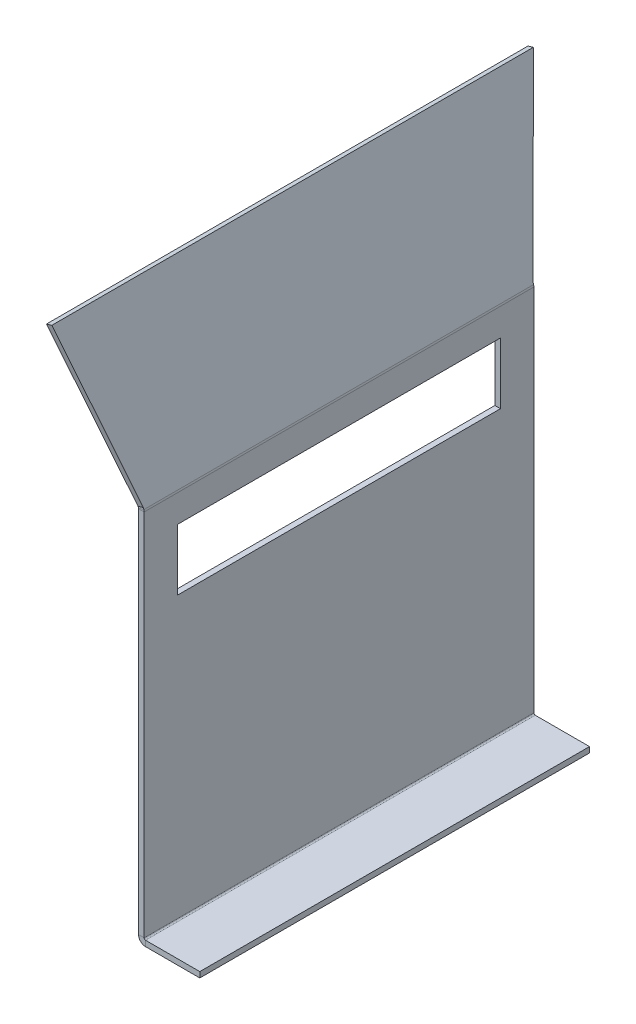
ISO-10303-21;
HEADER;
FILE_DESCRIPTION(('STEP AP214'),'2;1');
FILE_NAME('part.step','',(''),(''),'','','');
FILE_SCHEMA(('AUTOMOTIVE_DESIGN { 1 0 10303 214 1 1 1 1 }'));
ENDSEC;
DATA;
#1=APPLICATION_CONTEXT('core data for automotive mechanical design processes');
#2=APPLICATION_PROTOCOL_DEFINITION('international standard','automotive_design',2000,#1);
#3=PRODUCT_CONTEXT('',#1,'mechanical');
#4=PRODUCT('Part','Part','',(#3));
#5=PRODUCT_RELATED_PRODUCT_CATEGORY('part','',(#4));
#6=PRODUCT_DEFINITION_FORMATION('','',#4);
#7=PRODUCT_DEFINITION_CONTEXT('part definition',#1,'design');
#8=PRODUCT_DEFINITION('design','',#6,#7);
#9=PRODUCT_DEFINITION_SHAPE('','',#8);
#10=(LENGTH_UNIT() NAMED_UNIT(*) SI_UNIT(.MILLI.,.METRE.));
#11=(NAMED_UNIT(*) PLANE_ANGLE_UNIT() SI_UNIT($,.RADIAN.));
#12=(NAMED_UNIT(*) SI_UNIT($,.STERADIAN.) SOLID_ANGLE_UNIT());
#13=UNCERTAINTY_MEASURE_WITH_UNIT(LENGTH_MEASURE(1.E-05),#10,'distance_accuracy_value','');
#14=(GEOMETRIC_REPRESENTATION_CONTEXT(3) GLOBAL_UNCERTAINTY_ASSIGNED_CONTEXT((#13)) GLOBAL_UNIT_ASSIGNED_CONTEXT((#10,
#11,#12)) REPRESENTATION_CONTEXT('',''));
#15=CARTESIAN_POINT('',(0.,0.,0.));
#16=DIRECTION('',(0.,0.,1.));
#17=DIRECTION('',(1.,0.,0.));
#18=AXIS2_PLACEMENT_3D('',#15,#16,#17);
#19=CARTESIAN_POINT('',(0.,200.,130.));
#20=DIRECTION('',(-0.960645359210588,-0.277777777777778,0.));
#21=DIRECTION('',(0.277777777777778,-0.960645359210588,0.));
#22=AXIS2_PLACEMENT_3D('',#19,#20,#21);
#23=PLANE('',#22);
#24=DIRECTION('',(0.277777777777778,-0.960645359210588,0.));
#25=VECTOR('',#24,1.);
#26=CARTESIAN_POINT('',(0.,200.,105.));
#27=LINE('',#26,#25);
#28=CARTESIAN_POINT('',(-0.388544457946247,201.343712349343,105.));
#29=VERTEX_POINT('',#28);
#30=CARTESIAN_POINT('',(-0.147579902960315,200.51037901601,105.));
#31=VERTEX_POINT('',#30);
#32=EDGE_CURVE('E618',#29,#31,#27,.T.);
#33=ORIENTED_EDGE('',*,*,#32,.T.);
#34=DIRECTION('',(0.,0.,-1.));
#35=VECTOR('',#34,1.);
#36=CARTESIAN_POINT('',(-0.147579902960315,200.51037901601,130.));
#37=LINE('',#36,#35);
#38=CARTESIAN_POINT('',(-0.147579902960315,200.51037901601,-105.));
#39=VERTEX_POINT('',#38);
#40=EDGE_CURVE('E626',#31,#39,#37,.T.);
#41=ORIENTED_EDGE('',*,*,#40,.T.);
#42=DIRECTION('',(0.277777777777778,-0.960645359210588,0.));
#43=VECTOR('',#42,1.);
#44=CARTESIAN_POINT('',(0.,200.,-105.));
#45=LINE('',#44,#43);
#46=CARTESIAN_POINT('',(-0.388544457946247,201.343712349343,-105.));
#47=VERTEX_POINT('',#46);
#48=EDGE_CURVE('E561',#47,#39,#45,.T.);
#49=ORIENTED_EDGE('',*,*,#48,.F.);
#50=DIRECTION('',(0.267552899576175,-0.925284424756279,0.268819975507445));
#51=VECTOR('',#50,1.);
#52=CARTESIAN_POINT('',(-1.82616694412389,206.315475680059,-106.444430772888));
#53=LINE('',#52,#51);
#54=CARTESIAN_POINT('',(-25.,286.458082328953,-129.728010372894));
#55=VERTEX_POINT('',#54);
#56=EDGE_CURVE('E560',#55,#47,#53,.T.);
#57=ORIENTED_EDGE('',*,*,#56,.F.);
#58=DIRECTION('',(0.,0.,-1.));
#59=VECTOR('',#58,1.);
#60=CARTESIAN_POINT('',(-25.,286.458082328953,130.));
#61=LINE('',#60,#59);
#62=CARTESIAN_POINT('',(-25.,286.458082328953,129.728010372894));
#63=VERTEX_POINT('',#62);
#64=EDGE_CURVE('E363',#63,#55,#61,.T.);
#65=ORIENTED_EDGE('',*,*,#64,.F.);
#66=DIRECTION('',(0.267552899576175,-0.925284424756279,-0.268819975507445));
#67=VECTOR('',#66,1.);
#68=CARTESIAN_POINT('',(-1.82616694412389,206.315475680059,106.444430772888));
#69=LINE('',#68,#67);
#70=EDGE_CURVE('E390',#63,#29,#69,.T.);
#71=ORIENTED_EDGE('',*,*,#70,.T.);
#72=EDGE_LOOP('',(#33,#41,#49,#57,#65,#71));
#73=FACE_BOUND('',#72,.T.);
#74=ADVANCED_FACE('F356',(#73),#23,.F.);
#75=CARTESIAN_POINT('',(-27.8819360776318,285.62474899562,130.));
#76=DIRECTION('',(-0.277777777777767,0.960645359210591,0.));
#77=DIRECTION('',(-0.960645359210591,-0.277777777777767,0.));
#78=AXIS2_PLACEMENT_3D('',#75,#76,#77);
#79=PLANE('',#78);
#80=DIRECTION('',(0.,0.,-1.));
#81=VECTOR('',#80,1.);
#82=CARTESIAN_POINT('',(-27.8819360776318,285.62474899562,130.));
#83=LINE('',#82,#81);
#84=CARTESIAN_POINT('',(-27.8819360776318,285.62474899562,129.728010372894));
#85=VERTEX_POINT('',#84);
#86=CARTESIAN_POINT('',(-27.8819360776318,285.62474899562,-129.728010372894));
#87=VERTEX_POINT('',#86);
#88=EDGE_CURVE('E646',#85,#87,#83,.T.);
#89=ORIENTED_EDGE('',*,*,#88,.F.);
#90=DIRECTION('',(-0.960645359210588,-0.277777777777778,0.));
#91=VECTOR('',#90,1.);
#92=CARTESIAN_POINT('',(-27.8819360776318,285.62474899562,129.728010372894));
#93=LINE('',#92,#91);
#94=EDGE_CURVE('E398',#85,#63,#93,.F.);
#95=ORIENTED_EDGE('',*,*,#94,.T.);
#96=ORIENTED_EDGE('',*,*,#64,.T.);
#97=DIRECTION('',(-0.960645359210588,-0.277777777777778,0.));
#98=VECTOR('',#97,1.);
#99=CARTESIAN_POINT('',(-27.8819360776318,285.62474899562,-129.728010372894));
#100=LINE('',#99,#98);
#101=EDGE_CURVE('E564',#87,#55,#100,.F.);
#102=ORIENTED_EDGE('',*,*,#101,.F.);
#103=EDGE_LOOP('',(#89,#95,#96,#102));
#104=FACE_BOUND('',#103,.T.);
#105=ADVANCED_FACE('F651',(#104),#79,.T.);
#106=CARTESIAN_POINT('',(-2.88193607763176,199.166666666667,130.));
#107=DIRECTION('',(-0.960645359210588,-0.277777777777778,0.));
#108=DIRECTION('',(0.277777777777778,-0.960645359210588,0.));
#109=AXIS2_PLACEMENT_3D('',#106,#107,#108);
#110=PLANE('',#109);
#111=DIRECTION('',(0.,0.,-1.));
#112=VECTOR('',#111,1.);
#113=CARTESIAN_POINT('',(-3.02951598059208,199.677045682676,130.));
#114=LINE('',#113,#112);
#115=CARTESIAN_POINT('',(-3.02951598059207,199.677045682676,105.));
#116=VERTEX_POINT('',#115);
#117=CARTESIAN_POINT('',(-3.02951598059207,199.677045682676,-105.));
#118=VERTEX_POINT('',#117);
#119=EDGE_CURVE('E644',#116,#118,#114,.T.);
#120=ORIENTED_EDGE('',*,*,#119,.F.);
#121=DIRECTION('',(0.277777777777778,-0.960645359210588,0.));
#122=VECTOR('',#121,1.);
#123=CARTESIAN_POINT('',(-2.88193607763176,199.166666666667,105.));
#124=LINE('',#123,#122);
#125=CARTESIAN_POINT('',(-3.27048053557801,200.51037901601,105.));
#126=VERTEX_POINT('',#125);
#127=EDGE_CURVE('E616',#126,#116,#124,.T.);
#128=ORIENTED_EDGE('',*,*,#127,.F.);
#129=DIRECTION('',(0.267552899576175,-0.925284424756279,-0.268819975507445));
#130=VECTOR('',#129,1.);
#131=CARTESIAN_POINT('',(-4.70810302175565,205.482142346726,106.444430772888));
#132=LINE('',#131,#130);
#133=EDGE_CURVE('E395',#85,#126,#132,.T.);
#134=ORIENTED_EDGE('',*,*,#133,.F.);
#135=ORIENTED_EDGE('',*,*,#88,.T.);
#136=DIRECTION('',(0.267552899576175,-0.925284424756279,0.268819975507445));
#137=VECTOR('',#136,1.);
#138=CARTESIAN_POINT('',(-4.70810302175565,205.482142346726,-106.444430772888));
#139=LINE('',#138,#137);
#140=CARTESIAN_POINT('',(-3.27048053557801,200.51037901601,-105.));
#141=VERTEX_POINT('',#140);
#142=EDGE_CURVE('E552',#87,#141,#139,.T.);
#143=ORIENTED_EDGE('',*,*,#142,.T.);
#144=DIRECTION('',(0.277777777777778,-0.960645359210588,0.));
#145=VECTOR('',#144,1.);
#146=CARTESIAN_POINT('',(-2.88193607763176,199.166666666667,-105.));
#147=LINE('',#146,#145);
#148=EDGE_CURVE('E557',#141,#118,#147,.T.);
#149=ORIENTED_EDGE('',*,*,#148,.T.);
#150=EDGE_LOOP('',(#120,#128,#134,#135,#143,#149));
#151=FACE_BOUND('',#150,.T.);
#152=ADVANCED_FACE('F666',(#151),#110,.T.);
#153=CARTESIAN_POINT('',(-3.75000000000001,199.468712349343,130.));
#154=DIRECTION('',(0.,0.,-1.));
#155=DIRECTION('',(-1.,0.,0.));
#156=AXIS2_PLACEMENT_3D('',#153,#154,#155);
#157=CYLINDRICAL_SURFACE('',#156,0.75);
#158=DIRECTION('',(0.,0.,-1.));
#159=VECTOR('',#158,1.);
#160=CARTESIAN_POINT('',(-3.00000000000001,199.468712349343,130.));
#161=LINE('',#160,#159);
#162=CARTESIAN_POINT('',(-3.00000000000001,199.468712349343,105.));
#163=VERTEX_POINT('',#162);
#164=CARTESIAN_POINT('',(-3.00000000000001,199.468712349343,-105.));
#165=VERTEX_POINT('',#164);
#166=EDGE_CURVE('E642',#163,#165,#161,.T.);
#167=ORIENTED_EDGE('',*,*,#166,.F.);
#168=CARTESIAN_POINT('',(-3.75000000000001,199.468712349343,105.));
#169=DIRECTION('',(0.,0.,-1.));
#170=DIRECTION('',(-1.,0.,0.));
#171=AXIS2_PLACEMENT_3D('',#168,#169,#170);
#172=CIRCLE('',#171,0.75);
#173=EDGE_CURVE('E588',#116,#163,#172,.T.);
#174=ORIENTED_EDGE('',*,*,#173,.F.);
#175=ORIENTED_EDGE('',*,*,#119,.T.);
#176=CARTESIAN_POINT('',(-3.75000000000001,199.468712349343,-105.));
#177=DIRECTION('',(0.,0.,-1.));
#178=DIRECTION('',(-1.,0.,0.));
#179=AXIS2_PLACEMENT_3D('',#176,#177,#178);
#180=CIRCLE('',#179,0.75);
#181=EDGE_CURVE('E521',#118,#165,#180,.T.);
#182=ORIENTED_EDGE('',*,*,#181,.T.);
#183=EDGE_LOOP('',(#167,#174,#175,#182));
#184=FACE_BOUND('',#183,.T.);
#185=ADVANCED_FACE('F672',(#184),#157,.F.);
#186=CARTESIAN_POINT('',(-3.,0.,130.));
#187=DIRECTION('',(-1.,0.,0.));
#188=DIRECTION('',(0.,0.,1.));
#189=AXIS2_PLACEMENT_3D('',#186,#187,#188);
#190=PLANE('',#189);
#191=ORIENTED_EDGE('',*,*,#166,.T.);
#192=DIRECTION('',(0.,1.,0.));
#193=VECTOR('',#192,1.);
#194=CARTESIAN_POINT('',(-3.,0.,-105.));
#195=LINE('',#194,#193);
#196=CARTESIAN_POINT('',(-3.,0.75,-105.));
#197=VERTEX_POINT('',#196);
#198=EDGE_CURVE('E545',#165,#197,#195,.F.);
#199=ORIENTED_EDGE('',*,*,#198,.T.);
#200=DIRECTION('',(0.,0.,-1.));
#201=VECTOR('',#200,1.);
#202=CARTESIAN_POINT('',(-3.,0.75,130.));
#203=LINE('',#202,#201);
#204=CARTESIAN_POINT('',(-3.,0.75,105.));
#205=VERTEX_POINT('',#204);
#206=EDGE_CURVE('E640',#205,#197,#203,.T.);
#207=ORIENTED_EDGE('',*,*,#206,.F.);
#208=DIRECTION('',(0.,1.,0.));
#209=VECTOR('',#208,1.);
#210=CARTESIAN_POINT('',(-3.,0.,105.));
#211=LINE('',#210,#209);
#212=EDGE_CURVE('E609',#163,#205,#211,.F.);
#213=ORIENTED_EDGE('',*,*,#212,.F.);
#214=EDGE_LOOP('',(#191,#199,#207,#213));
#215=FACE_BOUND('',#214,.T.);
#216=DIRECTION('',(0.,0.,-1.));
#217=VECTOR('',#216,1.);
#218=CARTESIAN_POINT('',(-3.,184.677045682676,-26.6001579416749));
#219=LINE('',#218,#217);
#220=CARTESIAN_POINT('',(-3.,184.677045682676,87.));
#221=VERTEX_POINT('',#220);
#222=CARTESIAN_POINT('',(-3.,184.677045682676,-87.));
#223=VERTEX_POINT('',#222);
#224=EDGE_CURVE('E576',#221,#223,#219,.T.);
#225=ORIENTED_EDGE('',*,*,#224,.F.);
#226=DIRECTION('',(0.,1.,0.));
#227=VECTOR('',#226,1.);
#228=CARTESIAN_POINT('',(-3.,184.677045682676,87.));
#229=LINE('',#228,#227);
#230=CARTESIAN_POINT('',(-3.,151.677045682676,87.));
#231=VERTEX_POINT('',#230);
#232=EDGE_CURVE('E497',#231,#221,#229,.T.);
#233=ORIENTED_EDGE('',*,*,#232,.F.);
#234=DIRECTION('',(0.,0.,1.));
#235=VECTOR('',#234,1.);
#236=CARTESIAN_POINT('',(-3.,151.677045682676,-26.6001579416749));
#237=LINE('',#236,#235);
#238=CARTESIAN_POINT('',(-3.,151.677045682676,-87.));
#239=VERTEX_POINT('',#238);
#240=EDGE_CURVE('E490',#239,#231,#237,.T.);
#241=ORIENTED_EDGE('',*,*,#240,.F.);
#242=DIRECTION('',(0.,1.,0.));
#243=VECTOR('',#242,1.);
#244=CARTESIAN_POINT('',(-3.,184.677045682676,-87.));
#245=LINE('',#244,#243);
#246=EDGE_CURVE('E495',#239,#223,#245,.T.);
#247=ORIENTED_EDGE('',*,*,#246,.T.);
#248=EDGE_LOOP('',(#225,#233,#241,#247));
#249=FACE_BOUND('',#248,.T.);
#250=ADVANCED_FACE('F493',(#215,#249),#190,.T.);
#251=CARTESIAN_POINT('',(0.75,0.75,130.));
#252=DIRECTION('',(0.,0.,-1.));
#253=DIRECTION('',(-1.,0.,0.));
#254=AXIS2_PLACEMENT_3D('',#251,#252,#253);
#255=CYLINDRICAL_SURFACE('',#254,3.75);
#256=DIRECTION('',(0.,0.,-1.));
#257=VECTOR('',#256,1.);
#258=CARTESIAN_POINT('',(0.75,-3.,130.));
#259=LINE('',#258,#257);
#260=CARTESIAN_POINT('',(0.750000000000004,-3.,105.));
#261=VERTEX_POINT('',#260);
#262=CARTESIAN_POINT('',(0.750000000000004,-3.,-105.));
#263=VERTEX_POINT('',#262);
#264=EDGE_CURVE('E638',#261,#263,#259,.T.);
#265=ORIENTED_EDGE('',*,*,#264,.F.);
#266=CARTESIAN_POINT('',(0.75,0.75,105.));
#267=DIRECTION('',(0.,0.,-1.));
#268=DIRECTION('',(-1.,0.,0.));
#269=AXIS2_PLACEMENT_3D('',#266,#267,#268);
#270=CIRCLE('',#269,3.75);
#271=EDGE_CURVE('E593',#205,#261,#270,.F.);
#272=ORIENTED_EDGE('',*,*,#271,.F.);
#273=ORIENTED_EDGE('',*,*,#206,.T.);
#274=CARTESIAN_POINT('',(0.75,0.75,-105.));
#275=DIRECTION('',(0.,0.,-1.));
#276=DIRECTION('',(-1.,0.,0.));
#277=AXIS2_PLACEMENT_3D('',#274,#275,#276);
#278=CIRCLE('',#277,3.75);
#279=EDGE_CURVE('E527',#197,#263,#278,.F.);
#280=ORIENTED_EDGE('',*,*,#279,.T.);
#281=EDGE_LOOP('',(#265,#272,#273,#280));
#282=FACE_BOUND('',#281,.T.);
#283=ADVANCED_FACE('F683',(#282),#255,.T.);
#284=CARTESIAN_POINT('',(30.,-3.,130.));
#285=DIRECTION('',(0.,-1.,0.));
#286=DIRECTION('',(1.,0.,0.));
#287=AXIS2_PLACEMENT_3D('',#284,#285,#286);
#288=PLANE('',#287);
#289=DIRECTION('',(0.,0.,-1.));
#290=VECTOR('',#289,1.);
#291=CARTESIAN_POINT('',(30.,-3.,130.));
#292=LINE('',#291,#290);
#293=CARTESIAN_POINT('',(30.,-3.,105.));
#294=VERTEX_POINT('',#293);
#295=CARTESIAN_POINT('',(30.,-3.,-105.));
#296=VERTEX_POINT('',#295);
#297=EDGE_CURVE('E636',#294,#296,#292,.T.);
#298=ORIENTED_EDGE('',*,*,#297,.F.);
#299=DIRECTION('',(1.,0.,0.));
#300=VECTOR('',#299,1.);
#301=CARTESIAN_POINT('',(30.,-3.,105.));
#302=LINE('',#301,#300);
#303=EDGE_CURVE('E598',#261,#294,#302,.T.);
#304=ORIENTED_EDGE('',*,*,#303,.F.);
#305=ORIENTED_EDGE('',*,*,#264,.T.);
#306=DIRECTION('',(1.,0.,0.));
#307=VECTOR('',#306,1.);
#308=CARTESIAN_POINT('',(30.,-3.,-105.));
#309=LINE('',#308,#307);
#310=EDGE_CURVE('E533',#263,#296,#309,.T.);
#311=ORIENTED_EDGE('',*,*,#310,.T.);
#312=EDGE_LOOP('',(#298,#304,#305,#311));
#313=FACE_BOUND('',#312,.T.);
#314=ADVANCED_FACE('F701',(#313),#288,.T.);
#315=CARTESIAN_POINT('',(30.,0.,130.));
#316=DIRECTION('',(1.,0.,0.));
#317=DIRECTION('',(0.,0.,-1.));
#318=AXIS2_PLACEMENT_3D('',#315,#316,#317);
#319=PLANE('',#318);
#320=DIRECTION('',(0.,0.,-1.));
#321=VECTOR('',#320,1.);
#322=CARTESIAN_POINT('',(30.,0.,130.));
#323=LINE('',#322,#321);
#324=CARTESIAN_POINT('',(30.,0.,105.));
#325=VERTEX_POINT('',#324);
#326=CARTESIAN_POINT('',(30.,0.,-105.));
#327=VERTEX_POINT('',#326);
#328=EDGE_CURVE('E634',#325,#327,#323,.T.);
#329=ORIENTED_EDGE('',*,*,#328,.F.);
#330=DIRECTION('',(0.,1.,0.));
#331=VECTOR('',#330,1.);
#332=CARTESIAN_POINT('',(30.,0.,105.));
#333=LINE('',#332,#331);
#334=EDGE_CURVE('E601',#325,#294,#333,.F.);
#335=ORIENTED_EDGE('',*,*,#334,.T.);
#336=ORIENTED_EDGE('',*,*,#297,.T.);
#337=DIRECTION('',(0.,1.,0.));
#338=VECTOR('',#337,1.);
#339=CARTESIAN_POINT('',(30.,0.,-105.));
#340=LINE('',#339,#338);
#341=EDGE_CURVE('E537',#327,#296,#340,.F.);
#342=ORIENTED_EDGE('',*,*,#341,.F.);
#343=EDGE_LOOP('',(#329,#335,#336,#342));
#344=FACE_BOUND('',#343,.T.);
#345=ADVANCED_FACE('F708',(#344),#319,.T.);
#346=CARTESIAN_POINT('',(30.,0.,130.));
#347=DIRECTION('',(0.,-1.,0.));
#348=DIRECTION('',(1.,0.,0.));
#349=AXIS2_PLACEMENT_3D('',#346,#347,#348);
#350=PLANE('',#349);
#351=DIRECTION('',(1.,0.,0.));
#352=VECTOR('',#351,1.);
#353=CARTESIAN_POINT('',(30.,0.,105.));
#354=LINE('',#353,#352);
#355=CARTESIAN_POINT('',(0.750000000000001,0.,105.));
#356=VERTEX_POINT('',#355);
#357=EDGE_CURVE('E595',#356,#325,#354,.T.);
#358=ORIENTED_EDGE('',*,*,#357,.T.);
#359=ORIENTED_EDGE('',*,*,#328,.T.);
#360=DIRECTION('',(1.,0.,0.));
#361=VECTOR('',#360,1.);
#362=CARTESIAN_POINT('',(30.,0.,-105.));
#363=LINE('',#362,#361);
#364=CARTESIAN_POINT('',(0.750000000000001,0.,-105.));
#365=VERTEX_POINT('',#364);
#366=EDGE_CURVE('E530',#365,#327,#363,.T.);
#367=ORIENTED_EDGE('',*,*,#366,.F.);
#368=DIRECTION('',(0.,0.,-1.));
#369=VECTOR('',#368,1.);
#370=CARTESIAN_POINT('',(0.750000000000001,0.,130.));
#371=LINE('',#370,#369);
#372=EDGE_CURVE('E632',#356,#365,#371,.T.);
#373=ORIENTED_EDGE('',*,*,#372,.F.);
#374=EDGE_LOOP('',(#358,#359,#367,#373));
#375=FACE_BOUND('',#374,.T.);
#376=ADVANCED_FACE('F710',(#375),#350,.F.);
#377=CARTESIAN_POINT('',(0.75,0.75,130.));
#378=DIRECTION('',(0.,0.,-1.));
#379=DIRECTION('',(-1.,0.,0.));
#380=AXIS2_PLACEMENT_3D('',#377,#378,#379);
#381=CYLINDRICAL_SURFACE('',#380,0.75);
#382=CARTESIAN_POINT('',(0.75,0.75,105.));
#383=DIRECTION('',(0.,0.,-1.));
#384=DIRECTION('',(0.,1.,0.));
#385=AXIS2_PLACEMENT_3D('',#382,#383,#384);
#386=CIRCLE('',#385,0.75);
#387=CARTESIAN_POINT('',(0.,0.75,105.));
#388=VERTEX_POINT('',#387);
#389=EDGE_CURVE('E590',#388,#356,#386,.F.);
#390=ORIENTED_EDGE('',*,*,#389,.T.);
#391=ORIENTED_EDGE('',*,*,#372,.T.);
#392=CARTESIAN_POINT('',(0.75,0.75,-105.));
#393=DIRECTION('',(0.,0.,-1.));
#394=DIRECTION('',(0.,1.,0.));
#395=AXIS2_PLACEMENT_3D('',#392,#393,#394);
#396=CIRCLE('',#395,0.75);
#397=CARTESIAN_POINT('',(0.,0.75,-105.));
#398=VERTEX_POINT('',#397);
#399=EDGE_CURVE('E524',#398,#365,#396,.F.);
#400=ORIENTED_EDGE('',*,*,#399,.F.);
#401=DIRECTION('',(0.,0.,-1.));
#402=VECTOR('',#401,1.);
#403=CARTESIAN_POINT('',(0.,0.75,130.));
#404=LINE('',#403,#402);
#405=EDGE_CURVE('E630',#388,#398,#404,.T.);
#406=ORIENTED_EDGE('',*,*,#405,.F.);
#407=EDGE_LOOP('',(#390,#391,#400,#406));
#408=FACE_BOUND('',#407,.T.);
#409=ADVANCED_FACE('F717',(#408),#381,.F.);
#410=CARTESIAN_POINT('',(0.,0.,130.));
#411=DIRECTION('',(-1.,0.,0.));
#412=DIRECTION('',(0.,0.,1.));
#413=AXIS2_PLACEMENT_3D('',#410,#411,#412);
#414=PLANE('',#413);
#415=DIRECTION('',(0.,-1.,0.));
#416=VECTOR('',#415,1.);
#417=CARTESIAN_POINT('',(0.,0.,-105.));
#418=LINE('',#417,#416);
#419=CARTESIAN_POINT('',(0.,199.468712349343,-105.));
#420=VERTEX_POINT('',#419);
#421=EDGE_CURVE('E540',#420,#398,#418,.T.);
#422=ORIENTED_EDGE('',*,*,#421,.F.);
#423=DIRECTION('',(0.,0.,-1.));
#424=VECTOR('',#423,1.);
#425=CARTESIAN_POINT('',(0.,199.468712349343,130.));
#426=LINE('',#425,#424);
#427=CARTESIAN_POINT('',(0.,199.468712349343,105.));
#428=VERTEX_POINT('',#427);
#429=EDGE_CURVE('E628',#428,#420,#426,.T.);
#430=ORIENTED_EDGE('',*,*,#429,.F.);
#431=DIRECTION('',(0.,-1.,0.));
#432=VECTOR('',#431,1.);
#433=CARTESIAN_POINT('',(0.,0.,105.));
#434=LINE('',#433,#432);
#435=EDGE_CURVE('E604',#428,#388,#434,.T.);
#436=ORIENTED_EDGE('',*,*,#435,.T.);
#437=ORIENTED_EDGE('',*,*,#405,.T.);
#438=EDGE_LOOP('',(#422,#430,#436,#437));
#439=FACE_BOUND('',#438,.T.);
#440=DIRECTION('',(0.,1.,0.));
#441=VECTOR('',#440,1.);
#442=CARTESIAN_POINT('',(0.,0.,86.9999999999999));
#443=LINE('',#442,#441);
#444=CARTESIAN_POINT('',(0.,151.677045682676,87.));
#445=VERTEX_POINT('',#444);
#446=CARTESIAN_POINT('',(0.,184.677045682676,87.));
#447=VERTEX_POINT('',#446);
#448=EDGE_CURVE('E11',#445,#447,#443,.T.);
#449=ORIENTED_EDGE('',*,*,#448,.T.);
#450=DIRECTION('',(0.,0.,-1.));
#451=VECTOR('',#450,1.);
#452=CARTESIAN_POINT('',(0.,184.677045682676,130.));
#453=LINE('',#452,#451);
#454=CARTESIAN_POINT('',(0.,184.677045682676,-87.));
#455=VERTEX_POINT('',#454);
#456=EDGE_CURVE('E583',#447,#455,#453,.T.);
#457=ORIENTED_EDGE('',*,*,#456,.T.);
#458=DIRECTION('',(0.,1.,0.));
#459=VECTOR('',#458,1.);
#460=CARTESIAN_POINT('',(0.,0.,-86.9999999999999));
#461=LINE('',#460,#459);
#462=CARTESIAN_POINT('',(0.,151.677045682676,-87.));
#463=VERTEX_POINT('',#462);
#464=EDGE_CURVE('E500',#463,#455,#461,.T.);
#465=ORIENTED_EDGE('',*,*,#464,.F.);
#466=DIRECTION('',(0.,0.,1.));
#467=VECTOR('',#466,1.);
#468=CARTESIAN_POINT('',(0.,151.677045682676,130.));
#469=LINE('',#468,#467);
#470=EDGE_CURVE('E506',#463,#445,#469,.T.);
#471=ORIENTED_EDGE('',*,*,#470,.T.);
#472=EDGE_LOOP('',(#449,#457,#465,#471));
#473=FACE_BOUND('',#472,.T.);
#474=ADVANCED_FACE('F719',(#439,#473),#414,.F.);
#475=CARTESIAN_POINT('',(-3.75000000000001,199.468712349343,130.));
#476=DIRECTION('',(0.,0.,-1.));
#477=DIRECTION('',(-1.,0.,0.));
#478=AXIS2_PLACEMENT_3D('',#475,#476,#477);
#479=CYLINDRICAL_SURFACE('',#478,3.75);
#480=CARTESIAN_POINT('',(-3.75000000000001,199.468712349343,105.));
#481=DIRECTION('',(0.,0.,-1.));
#482=DIRECTION('',(0.,1.,0.));
#483=AXIS2_PLACEMENT_3D('',#480,#481,#482);
#484=CIRCLE('',#483,3.75);
#485=EDGE_CURVE('E585',#31,#428,#484,.T.);
#486=ORIENTED_EDGE('',*,*,#485,.T.);
#487=ORIENTED_EDGE('',*,*,#429,.T.);
#488=CARTESIAN_POINT('',(-3.75000000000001,199.468712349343,-105.));
#489=DIRECTION('',(0.,0.,-1.));
#490=DIRECTION('',(0.,1.,0.));
#491=AXIS2_PLACEMENT_3D('',#488,#489,#490);
#492=CIRCLE('',#491,3.75);
#493=EDGE_CURVE('E517',#39,#420,#492,.T.);
#494=ORIENTED_EDGE('',*,*,#493,.F.);
#495=ORIENTED_EDGE('',*,*,#40,.F.);
#496=EDGE_LOOP('',(#486,#487,#494,#495));
#497=FACE_BOUND('',#496,.T.);
#498=ADVANCED_FACE('F724',(#497),#479,.T.);
#499=CARTESIAN_POINT('',(-2.88193607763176,199.166666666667,105.));
#500=DIRECTION('',(0.,0.,-1.));
#501=DIRECTION('',(0.277777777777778,-0.960645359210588,0.));
#502=AXIS2_PLACEMENT_3D('',#499,#500,#501);
#503=PLANE('',#502);
#504=DIRECTION('',(-0.960645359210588,-0.277777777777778,0.));
#505=VECTOR('',#504,1.);
#506=CARTESIAN_POINT('',(-3.27048053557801,200.51037901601,105.));
#507=LINE('',#506,#505);
#508=EDGE_CURVE('E622',#126,#29,#507,.F.);
#509=ORIENTED_EDGE('',*,*,#508,.F.);
#510=ORIENTED_EDGE('',*,*,#127,.T.);
#511=DIRECTION('',(0.960645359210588,0.277777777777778,0.));
#512=VECTOR('',#511,1.);
#513=CARTESIAN_POINT('',(-0.147579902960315,200.51037901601,105.));
#514=LINE('',#513,#512);
#515=EDGE_CURVE('E379',#31,#116,#514,.F.);
#516=ORIENTED_EDGE('',*,*,#515,.F.);
#517=ORIENTED_EDGE('',*,*,#32,.F.);
#518=EDGE_LOOP('',(#509,#510,#516,#517));
#519=FACE_BOUND('',#518,.T.);
#520=ADVANCED_FACE('F669',(#519),#503,.F.);
#521=CARTESIAN_POINT('',(-4.70810302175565,205.482142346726,106.444430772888));
#522=DIRECTION('',(-0.0746722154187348,0.258240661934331,-0.963190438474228));
#523=DIRECTION('',(0.267552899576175,-0.925284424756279,-0.268819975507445));
#524=AXIS2_PLACEMENT_3D('',#521,#522,#523);
#525=PLANE('',#524);
#526=ORIENTED_EDGE('',*,*,#133,.T.);
#527=ORIENTED_EDGE('',*,*,#508,.T.);
#528=ORIENTED_EDGE('',*,*,#70,.F.);
#529=ORIENTED_EDGE('',*,*,#94,.F.);
#530=EDGE_LOOP('',(#526,#527,#528,#529));
#531=FACE_BOUND('',#530,.T.);
#532=ADVANCED_FACE('F763',(#531),#525,.F.);
#533=CARTESIAN_POINT('',(0.,0.,105.));
#534=DIRECTION('',(0.,0.,-1.));
#535=DIRECTION('',(0.,-1.,0.));
#536=AXIS2_PLACEMENT_3D('',#533,#534,#535);
#537=PLANE('',#536);
#538=DIRECTION('',(1.,0.,0.));
#539=VECTOR('',#538,1.);
#540=CARTESIAN_POINT('',(0.,0.75,105.));
#541=LINE('',#540,#539);
#542=EDGE_CURVE('E611',#388,#205,#541,.F.);
#543=ORIENTED_EDGE('',*,*,#542,.F.);
#544=ORIENTED_EDGE('',*,*,#435,.F.);
#545=DIRECTION('',(1.,0.,0.));
#546=VECTOR('',#545,1.);
#547=CARTESIAN_POINT('',(0.,199.468712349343,105.));
#548=LINE('',#547,#546);
#549=EDGE_CURVE('E370',#428,#163,#548,.F.);
#550=ORIENTED_EDGE('',*,*,#549,.T.);
#551=ORIENTED_EDGE('',*,*,#212,.T.);
#552=EDGE_LOOP('',(#543,#544,#550,#551));
#553=FACE_BOUND('',#552,.T.);
#554=ADVANCED_FACE('F676',(#553),#537,.F.);
#555=CARTESIAN_POINT('',(30.,0.,105.));
#556=DIRECTION('',(0.,0.,-1.));
#557=DIRECTION('',(1.,0.,0.));
#558=AXIS2_PLACEMENT_3D('',#555,#556,#557);
#559=PLANE('',#558);
#560=ORIENTED_EDGE('',*,*,#334,.F.);
#561=ORIENTED_EDGE('',*,*,#357,.F.);
#562=DIRECTION('',(0.,1.,0.));
#563=VECTOR('',#562,1.);
#564=CARTESIAN_POINT('',(0.750000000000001,0.,105.));
#565=LINE('',#564,#563);
#566=EDGE_CURVE('E600',#356,#261,#565,.F.);
#567=ORIENTED_EDGE('',*,*,#566,.T.);
#568=ORIENTED_EDGE('',*,*,#303,.T.);
#569=EDGE_LOOP('',(#560,#561,#567,#568));
#570=FACE_BOUND('',#569,.T.);
#571=ADVANCED_FACE('F704',(#570),#559,.F.);
#572=CARTESIAN_POINT('',(0.75,0.75,105.));
#573=DIRECTION('',(0.,0.,1.));
#574=DIRECTION('',(0.,-1.,0.));
#575=AXIS2_PLACEMENT_3D('',#572,#573,#574);
#576=PLANE('',#575);
#577=ORIENTED_EDGE('',*,*,#566,.F.);
#578=ORIENTED_EDGE('',*,*,#389,.F.);
#579=ORIENTED_EDGE('',*,*,#542,.T.);
#580=ORIENTED_EDGE('',*,*,#271,.T.);
#581=EDGE_LOOP('',(#577,#578,#579,#580));
#582=FACE_BOUND('',#581,.T.);
#583=ADVANCED_FACE('F714',(#582),#576,.T.);
#584=CARTESIAN_POINT('',(-3.75000000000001,199.468712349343,105.));
#585=DIRECTION('',(0.,0.,1.));
#586=DIRECTION('',(0.,-1.,0.));
#587=AXIS2_PLACEMENT_3D('',#584,#585,#586);
#588=PLANE('',#587);
#589=ORIENTED_EDGE('',*,*,#549,.F.);
#590=ORIENTED_EDGE('',*,*,#485,.F.);
#591=ORIENTED_EDGE('',*,*,#515,.T.);
#592=ORIENTED_EDGE('',*,*,#173,.T.);
#593=EDGE_LOOP('',(#589,#590,#591,#592));
#594=FACE_BOUND('',#593,.T.);
#595=ADVANCED_FACE('F673',(#594),#588,.T.);
#596=CARTESIAN_POINT('',(30.,184.677045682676,87.));
#597=DIRECTION('',(0.,0.,1.));
#598=DIRECTION('',(0.,-1.,0.));
#599=AXIS2_PLACEMENT_3D('',#596,#597,#598);
#600=PLANE('',#599);
#601=DIRECTION('',(-1.,0.,0.));
#602=VECTOR('',#601,1.);
#603=CARTESIAN_POINT('',(30.,151.677045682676,87.));
#604=LINE('',#603,#602);
#605=EDGE_CURVE('E578',#445,#231,#604,.T.);
#606=ORIENTED_EDGE('',*,*,#605,.T.);
#607=ORIENTED_EDGE('',*,*,#232,.T.);
#608=DIRECTION('',(-1.,0.,0.));
#609=VECTOR('',#608,1.);
#610=CARTESIAN_POINT('',(30.,184.677045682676,87.));
#611=LINE('',#610,#609);
#612=EDGE_CURVE('E579',#447,#221,#611,.T.);
#613=ORIENTED_EDGE('',*,*,#612,.F.);
#614=ORIENTED_EDGE('',*,*,#448,.F.);
#615=EDGE_LOOP('',(#606,#607,#613,#614));
#616=FACE_BOUND('',#615,.T.);
#617=ADVANCED_FACE('F776',(#616),#600,.F.);
#618=CARTESIAN_POINT('',(30.,184.677045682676,-26.6001579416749));
#619=DIRECTION('',(0.,1.,0.));
#620=DIRECTION('',(0.,0.,1.));
#621=AXIS2_PLACEMENT_3D('',#618,#619,#620);
#622=PLANE('',#621);
#623=ORIENTED_EDGE('',*,*,#612,.T.);
#624=ORIENTED_EDGE('',*,*,#224,.T.);
#625=DIRECTION('',(-1.,0.,0.));
#626=VECTOR('',#625,1.);
#627=CARTESIAN_POINT('',(30.,184.677045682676,-87.));
#628=LINE('',#627,#626);
#629=EDGE_CURVE('E510',#455,#223,#628,.T.);
#630=ORIENTED_EDGE('',*,*,#629,.F.);
#631=ORIENTED_EDGE('',*,*,#456,.F.);
#632=EDGE_LOOP('',(#623,#624,#630,#631));
#633=FACE_BOUND('',#632,.T.);
#634=ADVANCED_FACE('F779',(#633),#622,.F.);
#635=CARTESIAN_POINT('',(30.,151.677045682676,-26.6001579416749));
#636=DIRECTION('',(0.,-1.,0.));
#637=DIRECTION('',(0.,0.,-1.));
#638=AXIS2_PLACEMENT_3D('',#635,#636,#637);
#639=PLANE('',#638);
#640=ORIENTED_EDGE('',*,*,#470,.F.);
#641=DIRECTION('',(-1.,0.,0.));
#642=VECTOR('',#641,1.);
#643=CARTESIAN_POINT('',(30.,151.677045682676,-87.));
#644=LINE('',#643,#642);
#645=EDGE_CURVE('E503',#463,#239,#644,.T.);
#646=ORIENTED_EDGE('',*,*,#645,.T.);
#647=ORIENTED_EDGE('',*,*,#240,.T.);
#648=ORIENTED_EDGE('',*,*,#605,.F.);
#649=EDGE_LOOP('',(#640,#646,#647,#648));
#650=FACE_BOUND('',#649,.T.);
#651=ADVANCED_FACE('F504',(#650),#639,.F.);
#652=CARTESIAN_POINT('',(-2.88193607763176,199.166666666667,-105.));
#653=DIRECTION('',(0.,0.,1.));
#654=DIRECTION('',(0.277777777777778,-0.960645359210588,0.));
#655=AXIS2_PLACEMENT_3D('',#652,#653,#654);
#656=PLANE('',#655);
#657=DIRECTION('',(-0.960645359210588,-0.277777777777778,0.));
#658=VECTOR('',#657,1.);
#659=CARTESIAN_POINT('',(-3.27048053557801,200.51037901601,-105.));
#660=LINE('',#659,#658);
#661=EDGE_CURVE('E567',#141,#47,#660,.F.);
#662=ORIENTED_EDGE('',*,*,#661,.T.);
#663=ORIENTED_EDGE('',*,*,#48,.T.);
#664=DIRECTION('',(0.960645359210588,0.277777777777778,0.));
#665=VECTOR('',#664,1.);
#666=CARTESIAN_POINT('',(-0.147579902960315,200.51037901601,-105.));
#667=LINE('',#666,#665);
#668=EDGE_CURVE('E569',#39,#118,#667,.F.);
#669=ORIENTED_EDGE('',*,*,#668,.T.);
#670=ORIENTED_EDGE('',*,*,#148,.F.);
#671=EDGE_LOOP('',(#662,#663,#669,#670));
#672=FACE_BOUND('',#671,.T.);
#673=ADVANCED_FACE('F661',(#672),#656,.F.);
#674=CARTESIAN_POINT('',(-4.70810302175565,205.482142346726,-106.444430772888));
#675=DIRECTION('',(-0.0746722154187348,0.258240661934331,0.963190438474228));
#676=DIRECTION('',(0.267552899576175,-0.925284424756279,0.268819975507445));
#677=AXIS2_PLACEMENT_3D('',#674,#675,#676);
#678=PLANE('',#677);
#679=ORIENTED_EDGE('',*,*,#142,.F.);
#680=ORIENTED_EDGE('',*,*,#101,.T.);
#681=ORIENTED_EDGE('',*,*,#56,.T.);
#682=ORIENTED_EDGE('',*,*,#661,.F.);
#683=EDGE_LOOP('',(#679,#680,#681,#682));
#684=FACE_BOUND('',#683,.T.);
#685=ADVANCED_FACE('F656',(#684),#678,.F.);
#686=CARTESIAN_POINT('',(0.,0.,-105.));
#687=DIRECTION('',(0.,0.,1.));
#688=DIRECTION('',(0.,-1.,0.));
#689=AXIS2_PLACEMENT_3D('',#686,#687,#688);
#690=PLANE('',#689);
#691=DIRECTION('',(1.,0.,0.));
#692=VECTOR('',#691,1.);
#693=CARTESIAN_POINT('',(0.,0.75,-105.));
#694=LINE('',#693,#692);
#695=EDGE_CURVE('E549',#398,#197,#694,.F.);
#696=ORIENTED_EDGE('',*,*,#695,.T.);
#697=ORIENTED_EDGE('',*,*,#198,.F.);
#698=DIRECTION('',(1.,0.,0.));
#699=VECTOR('',#698,1.);
#700=CARTESIAN_POINT('',(0.,199.468712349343,-105.));
#701=LINE('',#700,#699);
#702=EDGE_CURVE('E548',#420,#165,#701,.F.);
#703=ORIENTED_EDGE('',*,*,#702,.F.);
#704=ORIENTED_EDGE('',*,*,#421,.T.);
#705=EDGE_LOOP('',(#696,#697,#703,#704));
#706=FACE_BOUND('',#705,.T.);
#707=ADVANCED_FACE('F687',(#706),#690,.F.);
#708=CARTESIAN_POINT('',(30.,0.,-105.));
#709=DIRECTION('',(0.,0.,1.));
#710=DIRECTION('',(1.,0.,0.));
#711=AXIS2_PLACEMENT_3D('',#708,#709,#710);
#712=PLANE('',#711);
#713=ORIENTED_EDGE('',*,*,#341,.T.);
#714=ORIENTED_EDGE('',*,*,#310,.F.);
#715=DIRECTION('',(0.,1.,0.));
#716=VECTOR('',#715,1.);
#717=CARTESIAN_POINT('',(0.750000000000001,0.,-105.));
#718=LINE('',#717,#716);
#719=EDGE_CURVE('E536',#365,#263,#718,.F.);
#720=ORIENTED_EDGE('',*,*,#719,.F.);
#721=ORIENTED_EDGE('',*,*,#366,.T.);
#722=EDGE_LOOP('',(#713,#714,#720,#721));
#723=FACE_BOUND('',#722,.T.);
#724=ADVANCED_FACE('F697',(#723),#712,.F.);
#725=CARTESIAN_POINT('',(0.75,0.75,-105.));
#726=DIRECTION('',(0.,0.,-1.));
#727=DIRECTION('',(0.,-1.,0.));
#728=AXIS2_PLACEMENT_3D('',#725,#726,#727);
#729=PLANE('',#728);
#730=ORIENTED_EDGE('',*,*,#719,.T.);
#731=ORIENTED_EDGE('',*,*,#279,.F.);
#732=ORIENTED_EDGE('',*,*,#695,.F.);
#733=ORIENTED_EDGE('',*,*,#399,.T.);
#734=EDGE_LOOP('',(#730,#731,#732,#733));
#735=FACE_BOUND('',#734,.T.);
#736=ADVANCED_FACE('F692',(#735),#729,.T.);
#737=CARTESIAN_POINT('',(-3.75000000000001,199.468712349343,-105.));
#738=DIRECTION('',(0.,0.,-1.));
#739=DIRECTION('',(0.,-1.,0.));
#740=AXIS2_PLACEMENT_3D('',#737,#738,#739);
#741=PLANE('',#740);
#742=ORIENTED_EDGE('',*,*,#702,.T.);
#743=ORIENTED_EDGE('',*,*,#181,.F.);
#744=ORIENTED_EDGE('',*,*,#668,.F.);
#745=ORIENTED_EDGE('',*,*,#493,.T.);
#746=EDGE_LOOP('',(#742,#743,#744,#745));
#747=FACE_BOUND('',#746,.T.);
#748=ADVANCED_FACE('F726',(#747),#741,.T.);
#749=CARTESIAN_POINT('',(30.,184.677045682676,-87.));
#750=DIRECTION('',(0.,0.,-1.));
#751=DIRECTION('',(0.,-1.,0.));
#752=AXIS2_PLACEMENT_3D('',#749,#750,#751);
#753=PLANE('',#752);
#754=ORIENTED_EDGE('',*,*,#645,.F.);
#755=ORIENTED_EDGE('',*,*,#464,.T.);
#756=ORIENTED_EDGE('',*,*,#629,.T.);
#757=ORIENTED_EDGE('',*,*,#246,.F.);
#758=EDGE_LOOP('',(#754,#755,#756,#757));
#759=FACE_BOUND('',#758,.T.);
#760=ADVANCED_FACE('F513',(#759),#753,.F.);
#761=CLOSED_SHELL('',(#74,#105,#152,#185,#250,#283,#314,#345,#376,#409,#474,#498,#520,#532,#554,
#571,#583,#595,#617,#634,#651,#673,#685,#707,#724,#736,#748,#760));
#762=MANIFOLD_SOLID_BREP('B2',#761);
#763=ADVANCED_BREP_SHAPE_REPRESENTATION('',(#18,#762),#14);
#764=SHAPE_DEFINITION_REPRESENTATION(#9,#763);
ENDSEC;
END-ISO-10303-21;
